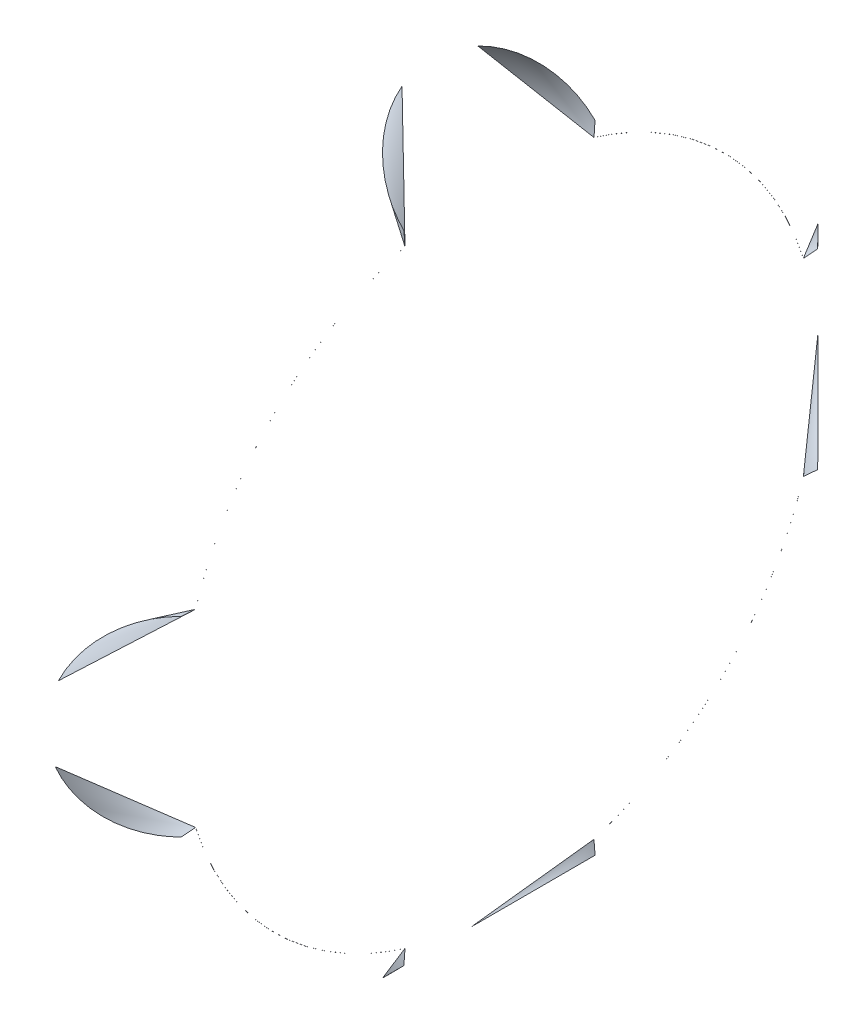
ISO-10303-21;
HEADER;
FILE_DESCRIPTION(('STEP AP214'),'2;1');
FILE_NAME('part.step','',(''),(''),'','','');
FILE_SCHEMA(('AUTOMOTIVE_DESIGN { 1 0 10303 214 1 1 1 1 }'));
ENDSEC;
DATA;
#1=APPLICATION_CONTEXT('core data for automotive mechanical design processes');
#2=APPLICATION_PROTOCOL_DEFINITION('international standard','automotive_design',2000,#1);
#3=PRODUCT_CONTEXT('',#1,'mechanical');
#4=PRODUCT('Part','Part','',(#3));
#5=PRODUCT_RELATED_PRODUCT_CATEGORY('part','',(#4));
#6=PRODUCT_DEFINITION_FORMATION('','',#4);
#7=PRODUCT_DEFINITION_CONTEXT('part definition',#1,'design');
#8=PRODUCT_DEFINITION('design','',#6,#7);
#9=PRODUCT_DEFINITION_SHAPE('','',#8);
#10=(LENGTH_UNIT() NAMED_UNIT(*) SI_UNIT(.MILLI.,.METRE.));
#11=(NAMED_UNIT(*) PLANE_ANGLE_UNIT() SI_UNIT($,.RADIAN.));
#12=(NAMED_UNIT(*) SI_UNIT($,.STERADIAN.) SOLID_ANGLE_UNIT());
#13=UNCERTAINTY_MEASURE_WITH_UNIT(LENGTH_MEASURE(1.E-05),#10,'distance_accuracy_value','');
#14=(GEOMETRIC_REPRESENTATION_CONTEXT(3) GLOBAL_UNCERTAINTY_ASSIGNED_CONTEXT((#13)) GLOBAL_UNIT_ASSIGNED_CONTEXT((#10,
#11,#12)) REPRESENTATION_CONTEXT('',''));
#15=CARTESIAN_POINT('',(0.,0.,0.));
#16=DIRECTION('',(0.,0.,1.));
#17=DIRECTION('',(1.,0.,0.));
#18=AXIS2_PLACEMENT_3D('',#15,#16,#17);
#19=CARTESIAN_POINT('',(4.5,0.,0.));
#20=DIRECTION('',(1.,0.,0.));
#21=DIRECTION('',(0.,-1.,0.));
#22=AXIS2_PLACEMENT_3D('',#19,#20,#21);
#23=TOROIDAL_SURFACE('',#22,10.,0.001);
#24=CARTESIAN_POINT('',(4.49961838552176,-2.96909588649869,-9.55002392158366));
#25=CARTESIAN_POINT('',(4.49956648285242,-2.96909263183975,-9.55000249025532));
#26=CARTESIAN_POINT('',(4.49951638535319,-2.9690887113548,-9.54997667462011));
#27=CARTESIAN_POINT('',(4.49942126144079,-2.9690796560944,-9.54991704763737));
#28=CARTESIAN_POINT('',(4.4993762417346,-2.96907451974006,-9.54988322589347));
#29=CARTESIAN_POINT('',(4.49929260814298,-2.96906319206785,-9.54980863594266));
#30=CARTESIAN_POINT('',(4.49925398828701,-2.9690570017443,-9.54976787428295));
#31=CARTESIAN_POINT('',(4.49918416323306,-2.96904374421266,-9.54968057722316));
#32=CARTESIAN_POINT('',(4.49915295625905,-2.96903667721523,-9.54963404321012));
#33=CARTESIAN_POINT('',(4.49909854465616,-2.96902180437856,-9.54953611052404));
#34=CARTESIAN_POINT('',(4.49907540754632,-2.96901399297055,-9.54948467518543));
#35=CARTESIAN_POINT('',(4.49903810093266,-2.96899790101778,-9.54937871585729));
#36=CARTESIAN_POINT('',(4.49902393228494,-2.96898962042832,-9.54932419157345));
#37=CARTESIAN_POINT('',(4.49900484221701,-2.96897274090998,-9.54921304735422));
#38=CARTESIAN_POINT('',(4.49900001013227,-2.96896413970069,-9.54915641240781));
#39=CARTESIAN_POINT('',(4.49899998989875,-2.96894693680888,-9.54904313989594));
#40=CARTESIAN_POINT('',(4.49900480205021,-2.96893833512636,-9.54898650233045));
#41=CARTESIAN_POINT('',(4.49902398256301,-2.9689213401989,-9.54887460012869));
#42=CARTESIAN_POINT('',(4.49903838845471,-2.96891294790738,-9.54881934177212));
#43=CARTESIAN_POINT('',(4.49907641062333,-2.96889664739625,-9.54871201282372));
#44=CARTESIAN_POINT('',(4.4991000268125,-2.96888873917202,-9.54865994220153));
#45=CARTESIAN_POINT('',(4.49915573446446,-2.9688736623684,-9.54856067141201));
#46=CARTESIAN_POINT('',(4.49918779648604,-2.96886649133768,-9.54851345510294));
#47=CARTESIAN_POINT('',(4.49925955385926,-2.96885306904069,-9.54842507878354));
#48=CARTESIAN_POINT('',(4.49929924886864,-2.96884681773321,-9.5483839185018));
#49=CARTESIAN_POINT('',(4.49938475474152,-2.9688354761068,-9.54830924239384));
#50=CARTESIAN_POINT('',(4.4994305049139,-2.96883037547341,-9.54827565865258));
#51=CARTESIAN_POINT('',(4.4995271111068,-2.96882141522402,-9.5482166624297));
#52=CARTESIAN_POINT('',(4.49957796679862,-2.9688175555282,-9.54819124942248));
#53=CARTESIAN_POINT('',(4.49968273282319,-2.96881123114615,-9.54814960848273));
#54=CARTESIAN_POINT('',(4.49973660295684,-2.96880875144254,-9.54813328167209));
#55=CARTESIAN_POINT('',(4.49984636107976,-2.96880519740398,-9.54810988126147));
#56=CARTESIAN_POINT('',(4.4999022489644,-2.96880412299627,-9.5481028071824));
#57=CARTESIAN_POINT('',(4.50001398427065,-2.96880341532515,-9.54809814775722));
#58=CARTESIAN_POINT('',(4.50006982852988,-2.96880377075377,-9.54810048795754));
#59=CARTESIAN_POINT('',(4.50018032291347,-2.96880588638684,-9.5481144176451));
#60=CARTESIAN_POINT('',(4.50023497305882,-2.96880764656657,-9.54812600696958));
#61=CARTESIAN_POINT('',(4.500341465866,-2.96881251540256,-9.54815806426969));
#62=CARTESIAN_POINT('',(4.50039331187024,-2.96881562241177,-9.5481785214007));
#63=CARTESIAN_POINT('',(4.50049282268,-2.96882309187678,-9.54822770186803));
#64=CARTESIAN_POINT('',(4.50054048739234,-2.96882745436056,-9.54825642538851));
#65=CARTESIAN_POINT('',(4.50063059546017,-2.96883733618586,-9.54832148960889));
#66=CARTESIAN_POINT('',(4.50067300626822,-2.96884286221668,-9.54835787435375));
#67=CARTESIAN_POINT('',(4.50075112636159,-2.96885489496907,-9.54843710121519));
#68=CARTESIAN_POINT('',(4.50078683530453,-2.96886140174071,-9.54847994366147));
#69=CARTESIAN_POINT('',(4.50085093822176,-2.96887528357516,-9.5485713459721));
#70=CARTESIAN_POINT('',(4.50087925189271,-2.96888266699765,-9.54861996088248));
#71=CARTESIAN_POINT('',(4.50092732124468,-2.96889803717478,-9.54872116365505));
#72=CARTESIAN_POINT('',(4.50094707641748,-2.96890602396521,-9.54877375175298));
#73=CARTESIAN_POINT('',(4.50097767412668,-2.96892246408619,-9.5488820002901));
#74=CARTESIAN_POINT('',(4.50098842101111,-2.96893092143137,-9.54893768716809));
#75=CARTESIAN_POINT('',(4.50100036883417,-2.9689479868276,-9.54905005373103));
#76=CARTESIAN_POINT('',(4.50100156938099,-2.96895659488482,-9.54910673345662));
#77=CARTESIAN_POINT('',(4.50099437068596,-2.96897377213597,-9.54921983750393));
#78=CARTESIAN_POINT('',(4.50098591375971,-2.9689823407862,-9.54927625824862));
#79=CARTESIAN_POINT('',(4.50095952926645,-2.96899914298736,-9.54938689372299));
#80=CARTESIAN_POINT('',(4.50094160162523,-2.96900737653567,-9.54944110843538));
#81=CARTESIAN_POINT('',(4.50089678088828,-2.96902326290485,-9.54954571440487));
#82=CARTESIAN_POINT('',(4.50086989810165,-2.96903091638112,-9.54959610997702));
#83=CARTESIAN_POINT('',(4.50080789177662,-2.96904542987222,-9.54969167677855));
#84=CARTESIAN_POINT('',(4.50077276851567,-2.96905228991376,-9.54973684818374));
#85=CARTESIAN_POINT('',(4.50069556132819,-2.96906496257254,-9.54982029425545));
#86=CARTESIAN_POINT('',(4.50065353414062,-2.96907078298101,-9.54985862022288));
#87=CARTESIAN_POINT('',(4.50056350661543,-2.96908126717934,-9.54992765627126));
#88=CARTESIAN_POINT('',(4.50051550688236,-2.96908593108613,-9.54995836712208));
#89=CARTESIAN_POINT('',(4.5004154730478,-2.96909391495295,-9.55001093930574));
#90=CARTESIAN_POINT('',(4.50036349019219,-2.96909724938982,-9.55003289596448));
#91=CARTESIAN_POINT('',(4.50025649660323,-2.96910254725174,-9.55006778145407));
#92=CARTESIAN_POINT('',(4.50020148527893,-2.96910451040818,-9.55008070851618));
#93=CARTESIAN_POINT('',(4.50009054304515,-2.96910699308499,-9.55009705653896));
#94=CARTESIAN_POINT('',(4.50003462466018,-2.96910752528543,-9.55010056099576));
#95=CARTESIAN_POINT('',(4.49992303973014,-2.96910716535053,-9.55009819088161));
#96=CARTESIAN_POINT('',(4.49986737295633,-2.96910627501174,-9.55009232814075));
#97=CARTESIAN_POINT('',(4.49977936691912,-2.96910372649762,-9.55007554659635));
#98=CARTESIAN_POINT('',(4.49974643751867,-2.96910250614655,-9.55006751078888));
#99=CARTESIAN_POINT('',(4.49968158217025,-2.96909956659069,-9.55004815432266));
#100=CARTESIAN_POINT('',(4.4996496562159,-2.96909784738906,-9.55003683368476));
#101=CARTESIAN_POINT('',(4.49961838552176,-2.96909588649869,-9.55002392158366));
#102=B_SPLINE_CURVE_WITH_KNOTS('',3,(#24,#25,#26,#27,#28,#29,#30,#31,#32,#33,#34,#35,#36,#37,
#38,#39,#40,#41,#42,#43,#44,#45,#46,#47,#48,#49,#50,#51,#52,#53,#54,#55,#56,#57,#58,#59,#60,#61,
#62,#63,#64,#65,#66,#67,#68,#69,#70,#71,#72,#73,#74,#75,#76,#77,#78,#79,#80,#81,#82,#83,#84,#85,
#86,#87,#88,#89,#90,#91,#92,#93,#94,#95,#96,#97,#98,#99,#100,#101),.UNSPECIFIED.,.T.,.F.,(4,2,2,
2,2,2,2,2,2,2,2,2,2,2,2,2,2,2,2,2,2,2,2,2,2,2,2,2,2,2,2,2,2,2,2,2,2,2,4),(0.,
0.000168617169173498,0.00033745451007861,0.000506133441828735,0.000674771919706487,
0.000844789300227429,0.00101482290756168,0.00118647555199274,0.00135813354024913,
0.00153046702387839,0.00170279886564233,0.00187453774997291,0.00204626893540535,
0.00221639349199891,0.00238650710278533,0.0025547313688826,0.00272294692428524,
0.00288983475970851,0.00305671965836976,0.00322340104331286,0.00339008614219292,
0.00355775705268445,0.00372543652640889,0.00389486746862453,0.0040643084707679,
0.00423552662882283,0.0044067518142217,0.00457900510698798,0.00475125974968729,
0.00492331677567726,0.00509536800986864,0.00526607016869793,0.00543675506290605,
0.00560552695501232,0.00577433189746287,0.00594163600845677,0.00610872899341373,
0.00621031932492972,0.006311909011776),.UNSPECIFIED.);
#103=CARTESIAN_POINT('',(4.49961838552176,-2.96909588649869,-9.55002392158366));
#104=VERTEX_POINT('',#103);
#105=EDGE_CURVE('E9',#104,#104,#102,.T.);
#106=ORIENTED_EDGE('',*,*,#105,.F.);
#107=EDGE_LOOP('',(#106));
#108=FACE_BOUND('',#107,.T.);
#109=CARTESIAN_POINT('',(4.49961838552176,-9.55002392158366,-2.96909588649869));
#110=CARTESIAN_POINT('',(4.49966970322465,-9.55004510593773,-2.96909910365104));
#111=CARTESIAN_POINT('',(4.49972285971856,-9.55006203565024,-2.96910167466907));
#112=CARTESIAN_POINT('',(4.49983133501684,-9.55008684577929,-2.96910544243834));
#113=CARTESIAN_POINT('',(4.49988665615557,-9.55009471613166,-2.96910663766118));
#114=CARTESIAN_POINT('',(4.49999783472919,-9.55010114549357,-2.96910761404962));
#115=CARTESIAN_POINT('',(4.50005369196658,-9.55009970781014,-2.96910739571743));
#116=CARTESIAN_POINT('',(4.50016435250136,-9.55008757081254,-2.96910555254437));
#117=CARTESIAN_POINT('',(4.50021915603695,-9.55007687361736,-2.96910392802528));
#118=CARTESIAN_POINT('',(4.50032612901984,-9.55004655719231,-2.96909932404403));
#119=CARTESIAN_POINT('',(4.50037830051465,-9.5500269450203,-2.9690963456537));
#120=CARTESIAN_POINT('',(4.50047860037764,-9.54997938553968,-2.96908912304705));
#121=CARTESIAN_POINT('',(4.50052672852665,-9.54995143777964,-2.96908487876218));
#122=CARTESIAN_POINT('',(4.50061787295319,-9.54988784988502,-2.96907522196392));
#123=CARTESIAN_POINT('',(4.5006608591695,-9.54985216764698,-2.96906980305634));
#124=CARTESIAN_POINT('',(4.50074023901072,-9.54977424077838,-2.96905796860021));
#125=CARTESIAN_POINT('',(4.50077663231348,-9.54973199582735,-2.96905155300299));
#126=CARTESIAN_POINT('',(4.50084219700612,-9.54964167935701,-2.96903783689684));
#127=CARTESIAN_POINT('',(4.500871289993,-9.54959355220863,-2.96903052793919));
#128=CARTESIAN_POINT('',(4.50092098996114,-9.54949319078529,-2.96901528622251));
#129=CARTESIAN_POINT('',(4.50094159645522,-9.54944095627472,-2.96900735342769));
#130=CARTESIAN_POINT('',(4.50097395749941,-9.54933326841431,-2.96899099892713));
#131=CARTESIAN_POINT('',(4.50098561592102,-9.54927778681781,-2.96898257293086));
#132=CARTESIAN_POINT('',(4.50099941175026,-9.54916567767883,-2.96896554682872));
#133=CARTESIAN_POINT('',(4.50100154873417,-9.54910905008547,-2.9689569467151));
#134=CARTESIAN_POINT('',(4.50099622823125,-9.54899587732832,-2.96893975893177));
#135=CARTESIAN_POINT('',(4.5009887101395,-9.54893933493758,-2.96893117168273));
#136=CARTESIAN_POINT('',(4.50096417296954,-9.54882830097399,-2.96891430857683));
#137=CARTESIAN_POINT('',(4.5009471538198,-9.54877380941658,-2.96890603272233));
#138=CARTESIAN_POINT('',(4.50090408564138,-9.54866848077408,-2.96889003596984));
#139=CARTESIAN_POINT('',(4.50087804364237,-9.54861764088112,-2.96888231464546));
#140=CARTESIAN_POINT('',(4.50081763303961,-9.54852104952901,-2.96886764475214));
#141=CARTESIAN_POINT('',(4.5007832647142,-9.54847529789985,-2.96886069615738));
#142=CARTESIAN_POINT('',(4.50070744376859,-9.5483905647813,-2.96884782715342));
#143=CARTESIAN_POINT('',(4.50066604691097,-9.54835153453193,-2.96884189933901));
#144=CARTESIAN_POINT('',(4.50057714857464,-9.54828099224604,-2.96883118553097));
#145=CARTESIAN_POINT('',(4.50052964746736,-9.54824947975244,-2.96882639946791));
#146=CARTESIAN_POINT('',(4.50043045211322,-9.54819523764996,-2.96881816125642));
#147=CARTESIAN_POINT('',(4.50037881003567,-9.54817241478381,-2.9688146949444));
#148=CARTESIAN_POINT('',(4.50027235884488,-9.5481357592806,-2.96880912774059));
#149=CARTESIAN_POINT('',(4.50021754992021,-9.54812192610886,-2.96880702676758));
#150=CARTESIAN_POINT('',(4.50010688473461,-9.54810376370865,-2.96880426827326));
#151=CARTESIAN_POINT('',(4.50005104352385,-9.54809934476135,-2.96880359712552));
#152=CARTESIAN_POINT('',(4.49993940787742,-9.54809987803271,-2.9688036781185));
#153=CARTESIAN_POINT('',(4.49988361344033,-9.54810482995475,-2.96880443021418));
#154=CARTESIAN_POINT('',(4.49977387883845,-9.54812391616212,-2.96880732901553));
#155=CARTESIAN_POINT('',(4.49971993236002,-9.54813801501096,-2.96880947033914));
#156=CARTESIAN_POINT('',(4.49961518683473,-9.5481749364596,-2.96881507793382));
#157=CARTESIAN_POINT('',(4.49956438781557,-9.54819775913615,-2.96881854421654));
#158=CARTESIAN_POINT('',(4.49946717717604,-9.548251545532,-2.96882671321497));
#159=CARTESIAN_POINT('',(4.49942078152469,-9.54828253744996,-2.96883142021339));
#160=CARTESIAN_POINT('',(4.49933384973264,-9.54835171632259,-2.96884192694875));
#161=CARTESIAN_POINT('',(4.49929331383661,-9.54838990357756,-2.9688477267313));
#162=CARTESIAN_POINT('',(4.49921884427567,-9.54847276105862,-2.9688603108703));
#163=CARTESIAN_POINT('',(4.49918497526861,-9.54851748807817,-2.96886710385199));
#164=CARTESIAN_POINT('',(4.49912521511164,-9.54861187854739,-2.96888143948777));
#165=CARTESIAN_POINT('',(4.4990993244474,-9.54866154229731,-2.96888898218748));
#166=CARTESIAN_POINT('',(4.49905595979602,-9.54876498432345,-2.96890469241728));
#167=CARTESIAN_POINT('',(4.49903858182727,-9.5488188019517,-2.96891286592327));
#168=CARTESIAN_POINT('',(4.49901312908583,-9.54892854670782,-2.96892953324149));
#169=CARTESIAN_POINT('',(4.49900505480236,-9.54898447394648,-2.96893802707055));
#170=CARTESIAN_POINT('',(4.49899839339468,-9.54909733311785,-2.96895516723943));
#171=CARTESIAN_POINT('',(4.49899988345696,-9.54915426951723,-2.96896381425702));
#172=CARTESIAN_POINT('',(4.49901249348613,-9.54926708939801,-2.96898094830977));
#173=CARTESIAN_POINT('',(4.49902361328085,-9.54932297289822,-2.96898943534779));
#174=CARTESIAN_POINT('',(4.49905521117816,-9.54943218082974,-2.96900602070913));
#175=CARTESIAN_POINT('',(4.49907570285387,-9.54948550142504,-2.96901411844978));
#176=CARTESIAN_POINT('',(4.49912550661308,-9.54958797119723,-2.96902968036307));
#177=CARTESIAN_POINT('',(4.49915482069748,-9.54963711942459,-2.96903714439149));
#178=CARTESIAN_POINT('',(4.49922128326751,-9.54972954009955,-2.96905118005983));
#179=CARTESIAN_POINT('',(4.49925839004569,-9.54977284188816,-2.96905775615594));
#180=CARTESIAN_POINT('',(4.49933947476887,-9.54985254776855,-2.96906986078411));
#181=CARTESIAN_POINT('',(4.49938344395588,-9.54988896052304,-2.96907539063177));
#182=CARTESIAN_POINT('',(4.49945958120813,-9.54994175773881,-2.96908340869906));
#183=CARTESIAN_POINT('',(4.49949006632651,-9.54996055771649,-2.96908626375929));
#184=CARTESIAN_POINT('',(4.49955290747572,-9.54999480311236,-2.9690914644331));
#185=CARTESIAN_POINT('',(4.49958526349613,-9.55001024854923,-2.9690938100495));
#186=CARTESIAN_POINT('',(4.49961838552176,-9.55002392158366,-2.96909588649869));
#187=B_SPLINE_CURVE_WITH_KNOTS('',3,(#109,#110,#111,#112,#113,#114,#115,#116,#117,#118,#119,
#120,#121,#122,#123,#124,#125,#126,#127,#128,#129,#130,#131,#132,#133,#134,#135,#136,#137,#138,
#139,#140,#141,#142,#143,#144,#145,#146,#147,#148,#149,#150,#151,#152,#153,#154,#155,#156,#157,
#158,#159,#160,#161,#162,#163,#164,#165,#166,#167,#168,#169,#170,#171,#172,#173,#174,#175,#176,
#177,#178,#179,#180,#181,#182,#183,#184,#185,#186),.UNSPECIFIED.,.T.,.F.,(4,2,2,2,2,2,2,2,2,2,2,
2,2,2,2,2,2,2,2,2,2,2,2,2,2,2,2,2,2,2,2,2,2,2,2,2,2,2,4),(0.,0.000166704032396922,
0.000333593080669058,0.000500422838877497,0.000667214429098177,0.000833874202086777,
0.00100054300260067,0.00116814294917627,0.00133575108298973,0.00150508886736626,
0.0016744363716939,0.00184557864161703,0.00201672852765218,0.00218895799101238,
0.00236118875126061,0.00253328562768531,0.0027053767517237,0.00287616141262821,
0.00304693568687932,0.0032158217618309,0.00338469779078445,0.00355195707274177,
0.00371921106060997,0.00388582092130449,0.00405243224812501,0.00421962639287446,
0.00438682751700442,0.00455557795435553,0.0047243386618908,0.00489496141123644,
0.00506559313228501,0.00523760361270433,0.00540961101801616,0.00558186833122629,
0.00575416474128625,0.00592556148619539,0.00609674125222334,0.00620433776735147,
0.00631193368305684),.UNSPECIFIED.);
#188=CARTESIAN_POINT('',(4.49961838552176,-9.55002392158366,-2.96909588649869));
#189=VERTEX_POINT('',#188);
#190=EDGE_CURVE('E34',#189,#189,#187,.T.);
#191=ORIENTED_EDGE('',*,*,#190,.F.);
#192=EDGE_LOOP('',(#191));
#193=FACE_BOUND('',#192,.T.);
#194=ADVANCED_FACE('F13',(#108,#193),#23,.T.);
#195=CARTESIAN_POINT('',(4.49961838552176,2.96909588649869,-9.55002392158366));
#196=CARTESIAN_POINT('',(4.49966970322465,2.96909910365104,-9.55004510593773));
#197=CARTESIAN_POINT('',(4.49972285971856,2.96910167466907,-9.55006203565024));
#198=CARTESIAN_POINT('',(4.49983133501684,2.96910544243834,-9.55008684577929));
#199=CARTESIAN_POINT('',(4.49988665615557,2.96910663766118,-9.55009471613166));
#200=CARTESIAN_POINT('',(4.49999783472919,2.96910761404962,-9.55010114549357));
#201=CARTESIAN_POINT('',(4.50005369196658,2.96910739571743,-9.55009970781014));
#202=CARTESIAN_POINT('',(4.50016435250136,2.96910555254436,-9.55008757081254));
#203=CARTESIAN_POINT('',(4.50021915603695,2.96910392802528,-9.55007687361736));
#204=CARTESIAN_POINT('',(4.50032612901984,2.96909932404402,-9.55004655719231));
#205=CARTESIAN_POINT('',(4.50037830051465,2.96909634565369,-9.5500269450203));
#206=CARTESIAN_POINT('',(4.50047860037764,2.96908912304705,-9.54997938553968));
#207=CARTESIAN_POINT('',(4.50052672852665,2.96908487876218,-9.54995143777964));
#208=CARTESIAN_POINT('',(4.50061787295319,2.96907522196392,-9.54988784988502));
#209=CARTESIAN_POINT('',(4.5006608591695,2.96906980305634,-9.54985216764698));
#210=CARTESIAN_POINT('',(4.50074023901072,2.96905796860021,-9.54977424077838));
#211=CARTESIAN_POINT('',(4.50077663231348,2.96905155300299,-9.54973199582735));
#212=CARTESIAN_POINT('',(4.50084219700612,2.96903783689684,-9.54964167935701));
#213=CARTESIAN_POINT('',(4.500871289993,2.96903052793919,-9.54959355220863));
#214=CARTESIAN_POINT('',(4.50092098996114,2.9690152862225,-9.54949319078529));
#215=CARTESIAN_POINT('',(4.50094159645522,2.96900735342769,-9.54944095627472));
#216=CARTESIAN_POINT('',(4.50097395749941,2.96899099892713,-9.54933326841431));
#217=CARTESIAN_POINT('',(4.50098561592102,2.96898257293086,-9.54927778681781));
#218=CARTESIAN_POINT('',(4.50099941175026,2.96896554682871,-9.54916567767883));
#219=CARTESIAN_POINT('',(4.50100154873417,2.9689569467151,-9.54910905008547));
#220=CARTESIAN_POINT('',(4.50099622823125,2.96893975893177,-9.54899587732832));
#221=CARTESIAN_POINT('',(4.5009887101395,2.96893117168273,-9.54893933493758));
#222=CARTESIAN_POINT('',(4.50096417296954,2.96891430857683,-9.54882830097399));
#223=CARTESIAN_POINT('',(4.5009471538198,2.96890603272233,-9.54877380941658));
#224=CARTESIAN_POINT('',(4.50090408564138,2.96889003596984,-9.54866848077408));
#225=CARTESIAN_POINT('',(4.50087804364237,2.96888231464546,-9.54861764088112));
#226=CARTESIAN_POINT('',(4.50081763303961,2.96886764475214,-9.54852104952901));
#227=CARTESIAN_POINT('',(4.5007832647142,2.96886069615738,-9.54847529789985));
#228=CARTESIAN_POINT('',(4.50070744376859,2.96884782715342,-9.5483905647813));
#229=CARTESIAN_POINT('',(4.50066604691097,2.96884189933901,-9.54835153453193));
#230=CARTESIAN_POINT('',(4.50057714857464,2.96883118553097,-9.54828099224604));
#231=CARTESIAN_POINT('',(4.50052964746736,2.96882639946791,-9.54824947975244));
#232=CARTESIAN_POINT('',(4.50043045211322,2.96881816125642,-9.54819523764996));
#233=CARTESIAN_POINT('',(4.50037881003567,2.9688146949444,-9.54817241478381));
#234=CARTESIAN_POINT('',(4.50027235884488,2.96880912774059,-9.5481357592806));
#235=CARTESIAN_POINT('',(4.50021754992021,2.96880702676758,-9.54812192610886));
#236=CARTESIAN_POINT('',(4.50010688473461,2.96880426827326,-9.54810376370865));
#237=CARTESIAN_POINT('',(4.50005104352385,2.96880359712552,-9.54809934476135));
#238=CARTESIAN_POINT('',(4.49993940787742,2.9688036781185,-9.54809987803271));
#239=CARTESIAN_POINT('',(4.49988361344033,2.96880443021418,-9.54810482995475));
#240=CARTESIAN_POINT('',(4.49977387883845,2.96880732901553,-9.54812391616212));
#241=CARTESIAN_POINT('',(4.49971993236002,2.96880947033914,-9.54813801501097));
#242=CARTESIAN_POINT('',(4.49961518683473,2.96881507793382,-9.5481749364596));
#243=CARTESIAN_POINT('',(4.49956438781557,2.96881854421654,-9.54819775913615));
#244=CARTESIAN_POINT('',(4.49946717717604,2.96882671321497,-9.548251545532));
#245=CARTESIAN_POINT('',(4.49942078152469,2.96883142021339,-9.54828253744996));
#246=CARTESIAN_POINT('',(4.49933384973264,2.96884192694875,-9.54835171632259));
#247=CARTESIAN_POINT('',(4.49929331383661,2.96884772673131,-9.54838990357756));
#248=CARTESIAN_POINT('',(4.49921884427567,2.9688603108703,-9.54847276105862));
#249=CARTESIAN_POINT('',(4.49918497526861,2.96886710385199,-9.54851748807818));
#250=CARTESIAN_POINT('',(4.49912521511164,2.96888143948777,-9.54861187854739));
#251=CARTESIAN_POINT('',(4.4990993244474,2.96888898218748,-9.54866154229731));
#252=CARTESIAN_POINT('',(4.49905595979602,2.96890469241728,-9.54876498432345));
#253=CARTESIAN_POINT('',(4.49903858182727,2.96891286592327,-9.5488188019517));
#254=CARTESIAN_POINT('',(4.49901312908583,2.96892953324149,-9.54892854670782));
#255=CARTESIAN_POINT('',(4.49900505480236,2.96893802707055,-9.54898447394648));
#256=CARTESIAN_POINT('',(4.49899839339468,2.96895516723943,-9.54909733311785));
#257=CARTESIAN_POINT('',(4.49899988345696,2.96896381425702,-9.54915426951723));
#258=CARTESIAN_POINT('',(4.49901249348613,2.96898094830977,-9.54926708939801));
#259=CARTESIAN_POINT('',(4.49902361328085,2.96898943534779,-9.54932297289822));
#260=CARTESIAN_POINT('',(4.49905521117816,2.96900602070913,-9.54943218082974));
#261=CARTESIAN_POINT('',(4.49907570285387,2.96901411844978,-9.54948550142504));
#262=CARTESIAN_POINT('',(4.49912550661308,2.96902968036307,-9.54958797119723));
#263=CARTESIAN_POINT('',(4.49915482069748,2.96903714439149,-9.54963711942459));
#264=CARTESIAN_POINT('',(4.49922128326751,2.96905118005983,-9.54972954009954));
#265=CARTESIAN_POINT('',(4.49925839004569,2.96905775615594,-9.54977284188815));
#266=CARTESIAN_POINT('',(4.49933947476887,2.96906986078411,-9.54985254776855));
#267=CARTESIAN_POINT('',(4.49938344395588,2.96907539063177,-9.54988896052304));
#268=CARTESIAN_POINT('',(4.49945958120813,2.96908340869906,-9.54994175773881));
#269=CARTESIAN_POINT('',(4.49949006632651,2.96908626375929,-9.54996055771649));
#270=CARTESIAN_POINT('',(4.49955290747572,2.9690914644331,-9.54999480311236));
#271=CARTESIAN_POINT('',(4.49958526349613,2.9690938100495,-9.55001024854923));
#272=CARTESIAN_POINT('',(4.49961838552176,2.96909588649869,-9.55002392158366));
#273=B_SPLINE_CURVE_WITH_KNOTS('',3,(#195,#196,#197,#198,#199,#200,#201,#202,#203,#204,#205,
#206,#207,#208,#209,#210,#211,#212,#213,#214,#215,#216,#217,#218,#219,#220,#221,#222,#223,#224,
#225,#226,#227,#228,#229,#230,#231,#232,#233,#234,#235,#236,#237,#238,#239,#240,#241,#242,#243,
#244,#245,#246,#247,#248,#249,#250,#251,#252,#253,#254,#255,#256,#257,#258,#259,#260,#261,#262,
#263,#264,#265,#266,#267,#268,#269,#270,#271,#272),.UNSPECIFIED.,.T.,.F.,(4,2,2,2,2,2,2,2,2,2,2,
2,2,2,2,2,2,2,2,2,2,2,2,2,2,2,2,2,2,2,2,2,2,2,2,2,2,2,4),(0.,0.000166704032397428,
0.000333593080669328,0.000500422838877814,0.000667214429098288,0.000833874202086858,
0.00100054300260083,0.00116814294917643,0.0013357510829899,0.00150508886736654,
0.00167443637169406,0.00184557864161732,0.00201672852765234,0.0021889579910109,
0.00236118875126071,0.00253328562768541,0.00270537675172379,0.0028761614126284,
0.00304693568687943,0.00321582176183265,0.00338469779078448,0.00355195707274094,
0.00371921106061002,0.00388582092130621,0.00405243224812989,0.00421962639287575,
0.00438682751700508,0.00455557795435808,0.00472433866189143,0.00489496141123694,
0.00506559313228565,0.00523760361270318,0.00540961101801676,0.00558186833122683,
0.00575416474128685,0.0059255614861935,0.0060967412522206,0.00620433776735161,
0.00631193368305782),.UNSPECIFIED.);
#274=CARTESIAN_POINT('',(4.49961838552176,2.96909588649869,-9.55002392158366));
#275=VERTEX_POINT('',#274);
#276=EDGE_CURVE('E25',#275,#275,#273,.T.);
#277=ORIENTED_EDGE('',*,*,#276,.F.);
#278=EDGE_LOOP('',(#277));
#279=FACE_BOUND('',#278,.T.);
#280=CARTESIAN_POINT('',(4.49953853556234,9.54821244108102,-2.96882077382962));
#281=CARTESIAN_POINT('',(4.49958780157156,9.54818681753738,-2.96881688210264));
#282=CARTESIAN_POINT('',(4.49963927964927,9.54816526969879,-2.96881360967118));
#283=CARTESIAN_POINT('',(4.4997452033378,9.5481310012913,-2.96880840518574));
#284=CARTESIAN_POINT('',(4.49979965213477,9.54811829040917,-2.96880647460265));
#285=CARTESIAN_POINT('',(4.49990992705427,9.54810210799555,-2.96880401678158));
#286=CARTESIAN_POINT('',(4.49996575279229,9.54809863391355,-2.96880348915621));
#287=CARTESIAN_POINT('',(4.50007718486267,9.54810102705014,-2.96880385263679));
#288=CARTESIAN_POINT('',(4.50013279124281,9.54810689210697,-2.96880474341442));
#289=CARTESIAN_POINT('',(4.50024209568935,9.54812775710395,-2.9688079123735));
#290=CARTESIAN_POINT('',(4.50029579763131,9.54814273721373,-2.96881018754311));
#291=CARTESIAN_POINT('',(4.50039991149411,9.54818136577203,-2.96881605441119));
#292=CARTESIAN_POINT('',(4.50045032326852,9.54820501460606,-2.9688196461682));
#293=CARTESIAN_POINT('',(4.50054664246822,9.54826038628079,-2.96882805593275));
#294=CARTESIAN_POINT('',(4.50059253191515,9.5482921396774,-2.96883287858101));
#295=CARTESIAN_POINT('',(4.50067833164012,9.54836274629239,-2.96884360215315));
#296=CARTESIAN_POINT('',(4.5007182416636,9.54840159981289,-2.96884950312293));
#297=CARTESIAN_POINT('',(4.5007913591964,9.54848569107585,-2.96886227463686));
#298=CARTESIAN_POINT('',(4.5008244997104,9.54853098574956,-2.96886915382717));
#299=CARTESIAN_POINT('',(4.50088271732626,9.54862638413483,-2.96888364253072));
#300=CARTESIAN_POINT('',(4.50090779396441,9.54867648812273,-2.96889125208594));
#301=CARTESIAN_POINT('',(4.50094945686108,9.54878067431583,-2.9689070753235));
#302=CARTESIAN_POINT('',(4.50096594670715,9.54883479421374,-2.96891529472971));
#303=CARTESIAN_POINT('',(4.50098958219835,9.54894499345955,-2.96893203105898));
#304=CARTESIAN_POINT('',(4.50099672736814,9.54900107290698,-2.96894054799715));
#305=CARTESIAN_POINT('',(4.50100150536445,9.54911406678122,-2.96895770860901));
#306=CARTESIAN_POINT('',(4.50099906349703,9.54917098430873,-2.96896635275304));
#307=CARTESIAN_POINT('',(4.50098456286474,9.54928361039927,-2.96898345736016));
#308=CARTESIAN_POINT('',(4.50097250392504,9.54933931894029,-2.96899191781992));
#309=CARTESIAN_POINT('',(4.50093906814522,9.5494480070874,-2.96900842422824));
#310=CARTESIAN_POINT('',(4.50091768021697,9.54950098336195,-2.96901646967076));
#311=CARTESIAN_POINT('',(4.50086615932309,9.54960260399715,-2.96903190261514));
#312=CARTESIAN_POINT('',(4.5008360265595,9.54965124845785,-2.96903929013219));
#313=CARTESIAN_POINT('',(4.5007680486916,9.54974249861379,-2.96905314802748));
#314=CARTESIAN_POINT('',(4.5007302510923,9.54978513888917,-2.9690596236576));
#315=CARTESIAN_POINT('',(4.50064788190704,9.54986345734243,-2.96907151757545));
#316=CARTESIAN_POINT('',(4.5006033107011,9.54989913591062,-2.96907693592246));
#317=CARTESIAN_POINT('',(4.50050916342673,9.54996211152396,-2.969086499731));
#318=CARTESIAN_POINT('',(4.50045964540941,9.54998949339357,-2.96909065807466));
#319=CARTESIAN_POINT('',(4.50035662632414,9.55003554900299,-2.969097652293));
#320=CARTESIAN_POINT('',(4.5003031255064,9.55005422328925,-2.96910048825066));
#321=CARTESIAN_POINT('',(4.50019426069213,9.55008214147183,-2.96910472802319));
#322=CARTESIAN_POINT('',(4.50013892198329,9.55009148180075,-2.96910614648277));
#323=CARTESIAN_POINT('',(4.50002744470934,9.5501007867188,-2.96910755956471));
#324=CARTESIAN_POINT('',(4.49997130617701,9.55010075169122,-2.96910755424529));
#325=CARTESIAN_POINT('',(4.49986015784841,9.55009133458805,-2.96910612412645));
#326=CARTESIAN_POINT('',(4.49980514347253,9.55008200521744,-2.96910470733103));
#327=CARTESIAN_POINT('',(4.49969747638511,9.55005436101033,-2.96910050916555));
#328=CARTESIAN_POINT('',(4.49964482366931,9.55003604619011,-2.96909772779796));
#329=CARTESIAN_POINT('',(4.49954327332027,9.54999094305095,-2.96909087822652));
#330=CARTESIAN_POINT('',(4.49949438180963,9.54996414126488,-2.96908680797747));
#331=CARTESIAN_POINT('',(4.49940179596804,9.54990286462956,-2.96907750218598));
#332=CARTESIAN_POINT('',(4.4993581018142,9.54986838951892,-2.96907226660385));
#333=CARTESIAN_POINT('',(4.49927676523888,9.54979245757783,-2.96906073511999));
#334=CARTESIAN_POINT('',(4.49923917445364,9.54975094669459,-2.96905443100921));
#335=CARTESIAN_POINT('',(4.49917148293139,9.54966233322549,-2.96904097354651));
#336=CARTESIAN_POINT('',(4.49914138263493,9.54961523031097,-2.96903382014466));
#337=CARTESIAN_POINT('',(4.49908917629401,9.54951621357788,-2.96901878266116));
#338=CARTESIAN_POINT('',(4.49906716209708,9.54946425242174,-2.96901089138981));
#339=CARTESIAN_POINT('',(4.49903217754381,9.54935743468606,-2.96899466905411));
#340=CARTESIAN_POINT('',(4.49901920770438,9.54930257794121,-2.96898633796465));
#341=CARTESIAN_POINT('',(4.49900257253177,9.54919098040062,-2.9689693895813));
#342=CARTESIAN_POINT('',(4.4989989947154,9.54913422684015,-2.96896077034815));
#343=CARTESIAN_POINT('',(4.49900149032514,9.54902092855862,-2.96894356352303));
#344=CARTESIAN_POINT('',(4.49900756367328,9.54896438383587,-2.96893497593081));
#345=CARTESIAN_POINT('',(4.49902923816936,9.54885290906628,-2.96891804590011));
#346=CARTESIAN_POINT('',(4.49904487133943,9.54879798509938,-2.96890970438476));
#347=CARTESIAN_POINT('',(4.49908528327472,9.54869151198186,-2.96889353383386));
#348=CARTESIAN_POINT('',(4.49911006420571,9.54863996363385,-2.96888570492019));
#349=CARTESIAN_POINT('',(4.49916799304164,9.54854192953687,-2.9688708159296));
#350=CARTESIAN_POINT('',(4.49920111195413,9.54849542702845,-2.96886375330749));
#351=CARTESIAN_POINT('',(4.49927482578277,9.54840869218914,-2.96885058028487));
#352=CARTESIAN_POINT('',(4.49931541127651,9.54836845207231,-2.96884446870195));
#353=CARTESIAN_POINT('',(4.49938674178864,9.54830889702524,-2.96883542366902));
#354=CARTESIAN_POINT('',(4.49941560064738,9.54828733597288,-2.96883214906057));
#355=CARTESIAN_POINT('',(4.49947550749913,9.54824742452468,-2.96882608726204));
#356=CARTESIAN_POINT('',(4.49950655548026,9.54822907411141,-2.96882330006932));
#357=CARTESIAN_POINT('',(4.49953853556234,9.54821244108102,-2.96882077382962));
#358=B_SPLINE_CURVE_WITH_KNOTS('',3,(#280,#281,#282,#283,#284,#285,#286,#287,#288,#289,#290,
#291,#292,#293,#294,#295,#296,#297,#298,#299,#300,#301,#302,#303,#304,#305,#306,#307,#308,#309,
#310,#311,#312,#313,#314,#315,#316,#317,#318,#319,#320,#321,#322,#323,#324,#325,#326,#327,#328,
#329,#330,#331,#332,#333,#334,#335,#336,#337,#338,#339,#340,#341,#342,#343,#344,#345,#346,#347,
#348,#349,#350,#351,#352,#353,#354,#355,#356,#357),.UNSPECIFIED.,.T.,.F.,(4,2,2,2,2,2,2,2,2,2,2,
2,2,2,2,2,2,2,2,2,2,2,2,2,2,2,2,2,2,2,2,2,2,2,2,2,2,2,4),(0.,0.000166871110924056,
0.000333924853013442,0.000500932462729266,0.00066790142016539,0.000834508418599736,
0.00100112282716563,0.00116837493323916,0.00133563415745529,0.00150447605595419,
0.00167332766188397,0.00184403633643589,0.00201475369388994,0.00218680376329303,
0.00235885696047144,0.00253111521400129,0.00270336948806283,0.00287458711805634,
0.00304579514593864,0.0032151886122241,0.00338457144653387,0.00355218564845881,
0.00371979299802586,0.00388645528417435,0.00405311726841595,0.00422004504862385,
0.00438697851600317,0.00455525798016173,0.00472354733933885,0.0048936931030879,
0.00506384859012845,0.00523558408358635,0.00540731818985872,0.00557963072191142,
0.00575198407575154,0.005923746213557,0.00609529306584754,0.00620361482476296,
0.00631193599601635),.UNSPECIFIED.);
#359=CARTESIAN_POINT('',(4.49953853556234,9.54821244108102,-2.96882077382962));
#360=VERTEX_POINT('',#359);
#361=EDGE_CURVE('E78',#360,#360,#358,.T.);
#362=ORIENTED_EDGE('',*,*,#361,.F.);
#363=EDGE_LOOP('',(#362));
#364=FACE_BOUND('',#363,.T.);
#365=ADVANCED_FACE('F101',(#279,#364),#23,.T.);
#366=CARTESIAN_POINT('',(4.49961838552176,-9.55002392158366,2.96909588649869));
#367=CARTESIAN_POINT('',(4.49956648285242,-9.55000249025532,2.96909263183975));
#368=CARTESIAN_POINT('',(4.49951638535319,-9.54997667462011,2.9690887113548));
#369=CARTESIAN_POINT('',(4.49942126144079,-9.54991704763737,2.96907965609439));
#370=CARTESIAN_POINT('',(4.4993762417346,-9.54988322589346,2.96907451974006));
#371=CARTESIAN_POINT('',(4.49929260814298,-9.54980863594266,2.96906319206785));
#372=CARTESIAN_POINT('',(4.49925398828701,-9.54976787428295,2.9690570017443));
#373=CARTESIAN_POINT('',(4.49918416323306,-9.54968057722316,2.96904374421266));
#374=CARTESIAN_POINT('',(4.49915295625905,-9.54963404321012,2.96903667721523));
#375=CARTESIAN_POINT('',(4.49909854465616,-9.54953611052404,2.96902180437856));
#376=CARTESIAN_POINT('',(4.49907540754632,-9.54948467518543,2.96901399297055));
#377=CARTESIAN_POINT('',(4.49903810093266,-9.54937871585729,2.96899790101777));
#378=CARTESIAN_POINT('',(4.49902393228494,-9.54932419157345,2.96898962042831));
#379=CARTESIAN_POINT('',(4.49900484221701,-9.54921304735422,2.96897274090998));
#380=CARTESIAN_POINT('',(4.49900001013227,-9.54915641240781,2.96896413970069));
#381=CARTESIAN_POINT('',(4.49899998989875,-9.54904313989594,2.96894693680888));
#382=CARTESIAN_POINT('',(4.49900480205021,-9.54898650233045,2.96893833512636));
#383=CARTESIAN_POINT('',(4.49902398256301,-9.54887460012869,2.9689213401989));
#384=CARTESIAN_POINT('',(4.49903838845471,-9.54881934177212,2.96891294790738));
#385=CARTESIAN_POINT('',(4.49907641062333,-9.54871201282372,2.96889664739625));
#386=CARTESIAN_POINT('',(4.4991000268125,-9.54865994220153,2.96888873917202));
#387=CARTESIAN_POINT('',(4.49915573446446,-9.54856067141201,2.9688736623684));
#388=CARTESIAN_POINT('',(4.49918779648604,-9.54851345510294,2.96886649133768));
#389=CARTESIAN_POINT('',(4.49925955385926,-9.54842507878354,2.96885306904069));
#390=CARTESIAN_POINT('',(4.49929924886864,-9.5483839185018,2.96884681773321));
#391=CARTESIAN_POINT('',(4.49938475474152,-9.54830924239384,2.9688354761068));
#392=CARTESIAN_POINT('',(4.4994305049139,-9.54827565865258,2.96883037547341));
#393=CARTESIAN_POINT('',(4.4995271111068,-9.5482166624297,2.96882141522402));
#394=CARTESIAN_POINT('',(4.49957796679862,-9.54819124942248,2.96881755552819));
#395=CARTESIAN_POINT('',(4.49968273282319,-9.54814960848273,2.96881123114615));
#396=CARTESIAN_POINT('',(4.49973660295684,-9.54813328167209,2.96880875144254));
#397=CARTESIAN_POINT('',(4.49984636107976,-9.54810988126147,2.96880519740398));
#398=CARTESIAN_POINT('',(4.4999022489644,-9.5481028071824,2.96880412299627));
#399=CARTESIAN_POINT('',(4.50001398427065,-9.54809814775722,2.96880341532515));
#400=CARTESIAN_POINT('',(4.50006982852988,-9.54810048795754,2.96880377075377));
#401=CARTESIAN_POINT('',(4.50018032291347,-9.5481144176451,2.96880588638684));
#402=CARTESIAN_POINT('',(4.50023497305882,-9.54812600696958,2.96880764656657));
#403=CARTESIAN_POINT('',(4.500341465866,-9.54815806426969,2.96881251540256));
#404=CARTESIAN_POINT('',(4.50039331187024,-9.5481785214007,2.96881562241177));
#405=CARTESIAN_POINT('',(4.50049282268,-9.54822770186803,2.96882309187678));
#406=CARTESIAN_POINT('',(4.50054048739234,-9.54825642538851,2.96882745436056));
#407=CARTESIAN_POINT('',(4.50063059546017,-9.54832148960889,2.96883733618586));
#408=CARTESIAN_POINT('',(4.50067300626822,-9.54835787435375,2.96884286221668));
#409=CARTESIAN_POINT('',(4.50075112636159,-9.54843710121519,2.96885489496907));
#410=CARTESIAN_POINT('',(4.50078683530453,-9.54847994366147,2.96886140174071));
#411=CARTESIAN_POINT('',(4.50085093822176,-9.5485713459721,2.96887528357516));
#412=CARTESIAN_POINT('',(4.50087925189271,-9.54861996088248,2.96888266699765));
#413=CARTESIAN_POINT('',(4.50092732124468,-9.54872116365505,2.96889803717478));
#414=CARTESIAN_POINT('',(4.50094707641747,-9.54877375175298,2.96890602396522));
#415=CARTESIAN_POINT('',(4.50097767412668,-9.5488820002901,2.96892246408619));
#416=CARTESIAN_POINT('',(4.50098842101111,-9.54893768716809,2.96893092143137));
#417=CARTESIAN_POINT('',(4.50100036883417,-9.54905005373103,2.9689479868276));
#418=CARTESIAN_POINT('',(4.50100156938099,-9.54910673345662,2.96895659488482));
#419=CARTESIAN_POINT('',(4.50099437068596,-9.54921983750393,2.96897377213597));
#420=CARTESIAN_POINT('',(4.50098591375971,-9.54927625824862,2.9689823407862));
#421=CARTESIAN_POINT('',(4.50095952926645,-9.54938689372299,2.96899914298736));
#422=CARTESIAN_POINT('',(4.50094160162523,-9.54944110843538,2.96900737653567));
#423=CARTESIAN_POINT('',(4.50089678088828,-9.54954571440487,2.96902326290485));
#424=CARTESIAN_POINT('',(4.50086989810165,-9.54959610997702,2.96903091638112));
#425=CARTESIAN_POINT('',(4.50080789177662,-9.54969167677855,2.96904542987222));
#426=CARTESIAN_POINT('',(4.50077276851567,-9.54973684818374,2.96905228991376));
#427=CARTESIAN_POINT('',(4.50069556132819,-9.54982029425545,2.96906496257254));
#428=CARTESIAN_POINT('',(4.50065353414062,-9.54985862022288,2.96907078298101));
#429=CARTESIAN_POINT('',(4.50056350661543,-9.54992765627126,2.96908126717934));
#430=CARTESIAN_POINT('',(4.50051550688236,-9.54995836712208,2.96908593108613));
#431=CARTESIAN_POINT('',(4.5004154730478,-9.55001093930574,2.96909391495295));
#432=CARTESIAN_POINT('',(4.50036349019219,-9.55003289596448,2.96909724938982));
#433=CARTESIAN_POINT('',(4.50025649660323,-9.55006778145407,2.96910254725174));
#434=CARTESIAN_POINT('',(4.50020148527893,-9.55008070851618,2.96910451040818));
#435=CARTESIAN_POINT('',(4.50009054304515,-9.55009705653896,2.96910699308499));
#436=CARTESIAN_POINT('',(4.50003462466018,-9.55010056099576,2.96910752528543));
#437=CARTESIAN_POINT('',(4.49992303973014,-9.55009819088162,2.96910716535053));
#438=CARTESIAN_POINT('',(4.49986737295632,-9.55009232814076,2.96910627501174));
#439=CARTESIAN_POINT('',(4.49977936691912,-9.55007554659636,2.96910372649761));
#440=CARTESIAN_POINT('',(4.49974643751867,-9.55006751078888,2.96910250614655));
#441=CARTESIAN_POINT('',(4.49968158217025,-9.55004815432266,2.96909956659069));
#442=CARTESIAN_POINT('',(4.4996496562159,-9.55003683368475,2.96909784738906));
#443=CARTESIAN_POINT('',(4.49961838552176,-9.55002392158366,2.96909588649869));
#444=B_SPLINE_CURVE_WITH_KNOTS('',3,(#366,#367,#368,#369,#370,#371,#372,#373,#374,#375,#376,
#377,#378,#379,#380,#381,#382,#383,#384,#385,#386,#387,#388,#389,#390,#391,#392,#393,#394,#395,
#396,#397,#398,#399,#400,#401,#402,#403,#404,#405,#406,#407,#408,#409,#410,#411,#412,#413,#414,
#415,#416,#417,#418,#419,#420,#421,#422,#423,#424,#425,#426,#427,#428,#429,#430,#431,#432,#433,
#434,#435,#436,#437,#438,#439,#440,#441,#442,#443),.UNSPECIFIED.,.T.,.F.,(4,2,2,2,2,2,2,2,2,2,2,
2,2,2,2,2,2,2,2,2,2,2,2,2,2,2,2,2,2,2,2,2,2,2,2,2,2,2,4),(0.,0.000168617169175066,
0.000337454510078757,0.000506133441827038,0.000674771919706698,0.000844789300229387,
0.00101482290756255,0.00118647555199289,0.00135813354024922,0.00153046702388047,
0.00170279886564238,0.00187453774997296,0.0020462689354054,0.00221639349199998,
0.00238650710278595,0.00255473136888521,0.00272294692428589,0.00288983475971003,
0.00305671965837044,0.00322340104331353,0.00339008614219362,0.00355775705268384,
0.00372543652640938,0.00389486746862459,0.00406430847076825,0.00423552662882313,
0.00440675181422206,0.00457900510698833,0.00475125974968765,0.00492331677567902,
0.00509536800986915,0.00526607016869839,0.00543675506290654,0.00560552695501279,
0.00577433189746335,0.00594163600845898,0.00610872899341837,0.00621031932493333,
0.00631190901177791),.UNSPECIFIED.);
#445=CARTESIAN_POINT('',(4.49961838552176,-9.55002392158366,2.96909588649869));
#446=VERTEX_POINT('',#445);
#447=EDGE_CURVE('E41',#446,#446,#444,.T.);
#448=ORIENTED_EDGE('',*,*,#447,.F.);
#449=EDGE_LOOP('',(#448));
#450=FACE_BOUND('',#449,.T.);
#451=CARTESIAN_POINT('',(4.49953853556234,-2.96882077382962,9.54821244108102));
#452=CARTESIAN_POINT('',(4.4994886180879,-2.96882471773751,9.54823840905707));
#453=CARTESIAN_POINT('',(4.49944089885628,-2.96882930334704,9.54826860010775));
#454=CARTESIAN_POINT('',(4.49935124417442,-2.96883961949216,9.54833652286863));
#455=CARTESIAN_POINT('',(4.49930931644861,-2.96884535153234,9.54837426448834));
#456=CARTESIAN_POINT('',(4.49923248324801,-2.96885778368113,9.54845612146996));
#457=CARTESIAN_POINT('',(4.49919757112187,-2.96886448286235,9.54850023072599));
#458=CARTESIAN_POINT('',(4.49913567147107,-2.9688786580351,9.5485935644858));
#459=CARTESIAN_POINT('',(4.49910868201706,-2.9688861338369,9.54864278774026));
#460=CARTESIAN_POINT('',(4.4990631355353,-2.96890171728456,9.5487453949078));
#461=CARTESIAN_POINT('',(4.49904464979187,-2.96890982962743,9.54879880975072));
#462=CARTESIAN_POINT('',(4.4990169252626,-2.96892640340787,9.54890793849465));
#463=CARTESIAN_POINT('',(4.49900768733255,-2.96893486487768,9.54896365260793));
#464=CARTESIAN_POINT('',(4.49899866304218,-2.96895197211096,9.54907629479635));
#465=CARTESIAN_POINT('',(4.49899895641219,-2.96896061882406,9.54913322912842));
#466=CARTESIAN_POINT('',(4.4990091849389,-2.96897778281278,9.54924624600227));
#467=CARTESIAN_POINT('',(4.49901912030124,-2.96898630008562,9.54930232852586));
#468=CARTESIAN_POINT('',(4.49904840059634,-2.96900298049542,9.54941216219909));
#469=CARTESIAN_POINT('',(4.49906776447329,-2.96901114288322,9.54946590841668));
#470=CARTESIAN_POINT('',(4.49911539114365,-2.96902685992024,9.54956939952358));
#471=CARTESIAN_POINT('',(4.49914365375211,-2.9690344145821,9.54961914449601));
#472=CARTESIAN_POINT('',(4.49920813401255,-2.9690486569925,9.54971292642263));
#473=CARTESIAN_POINT('',(4.49924430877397,-2.96905534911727,9.54975699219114));
#474=CARTESIAN_POINT('',(4.49932369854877,-2.96906771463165,9.549838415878));
#475=CARTESIAN_POINT('',(4.49936691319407,-2.96907338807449,9.54987577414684));
#476=CARTESIAN_POINT('',(4.49945868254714,-2.96908349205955,9.54994230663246));
#477=CARTESIAN_POINT('',(4.49950717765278,-2.96908793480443,9.54997156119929));
#478=CARTESIAN_POINT('',(4.49960848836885,-2.96909551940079,9.55002150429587));
#479=CARTESIAN_POINT('',(4.49966130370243,-2.96909866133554,9.55004219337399));
#480=CARTESIAN_POINT('',(4.49976914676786,-2.96910352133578,9.55007419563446));
#481=CARTESIAN_POINT('',(4.49982414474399,-2.96910525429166,9.55008560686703));
#482=CARTESIAN_POINT('',(4.49993529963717,-2.96910729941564,9.5500990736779));
#483=CARTESIAN_POINT('',(4.49999145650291,-2.96910761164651,9.55010112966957));
#484=CARTESIAN_POINT('',(4.5001029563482,-2.96910680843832,9.55009584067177));
#485=CARTESIAN_POINT('',(4.50015830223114,-2.96910570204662,9.55008855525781));
#486=CARTESIAN_POINT('',(4.50026697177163,-2.96910211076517,9.55006490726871));
#487=CARTESIAN_POINT('',(4.50032029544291,-2.96909962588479,9.55004854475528));
#488=CARTESIAN_POINT('',(4.50042346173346,-2.96909334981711,9.55000721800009));
#489=CARTESIAN_POINT('',(4.50047330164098,-2.96908955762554,9.54998224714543));
#490=CARTESIAN_POINT('',(4.50056807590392,-2.96908077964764,9.54992444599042));
#491=CARTESIAN_POINT('',(4.50061301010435,-2.96907579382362,9.54989161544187));
#492=CARTESIAN_POINT('',(4.50069706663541,-2.96906473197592,9.54981877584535));
#493=CARTESIAN_POINT('',(4.50073614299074,-2.96905864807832,9.54977871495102));
#494=CARTESIAN_POINT('',(4.50080702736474,-2.96904559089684,9.54969273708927));
#495=CARTESIAN_POINT('',(4.50083883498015,-2.96903861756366,9.54964681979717));
#496=CARTESIAN_POINT('',(4.50089464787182,-2.96902389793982,9.54954989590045));
#497=CARTESIAN_POINT('',(4.50091856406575,-2.96901614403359,9.54949883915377));
#498=CARTESIAN_POINT('',(4.50095748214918,-2.96900014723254,9.54939350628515));
#499=CARTESIAN_POINT('',(4.50097248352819,-2.96899190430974,9.54933922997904));
#500=CARTESIAN_POINT('',(4.50099328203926,-2.96897507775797,9.54922843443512));
#501=CARTESIAN_POINT('',(4.5009989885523,-2.96896649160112,9.54917189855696));
#502=CARTESIAN_POINT('',(4.50100076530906,-2.96894929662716,9.54905867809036));
#503=CARTESIAN_POINT('',(4.50099683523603,-2.96894068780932,9.5490019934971));
#504=CARTESIAN_POINT('',(4.5009794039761,-2.96892365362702,9.54888983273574));
#505=CARTESIAN_POINT('',(4.50096586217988,-2.96891522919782,9.54883436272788));
#506=CARTESIAN_POINT('',(4.50092952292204,-2.96889884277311,9.54872646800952));
#507=CARTESIAN_POINT('',(4.50090672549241,-2.968890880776,9.54867404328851));
#508=CARTESIAN_POINT('',(4.50085257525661,-2.96887567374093,9.54857391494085));
#509=CARTESIAN_POINT('',(4.50082124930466,-2.9688684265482,9.54852619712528));
#510=CARTESIAN_POINT('',(4.50075086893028,-2.9688548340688,9.54843670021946));
#511=CARTESIAN_POINT('',(4.50071181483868,-2.96884848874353,9.54839492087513));
#512=CARTESIAN_POINT('',(4.5006274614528,-2.96883694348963,9.5483189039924));
#513=CARTESIAN_POINT('',(4.50058222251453,-2.96883173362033,9.54828460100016));
#514=CARTESIAN_POINT('',(4.50048650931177,-2.96882254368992,9.54822409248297));
#515=CARTESIAN_POINT('',(4.50043603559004,-2.96881856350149,9.54819788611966));
#516=CARTESIAN_POINT('',(4.50033189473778,-2.96881199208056,9.54815461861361));
#517=CARTESIAN_POINT('',(4.50027826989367,-2.96880938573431,9.54813745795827));
#518=CARTESIAN_POINT('',(4.50016884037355,-2.96880557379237,9.54811235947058));
#519=CARTESIAN_POINT('',(4.50011303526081,-2.96880436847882,9.54810442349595));
#520=CARTESIAN_POINT('',(4.50000130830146,-2.96880340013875,9.54809804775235));
#521=CARTESIAN_POINT('',(4.49994539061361,-2.96880362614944,9.54809953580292));
#522=CARTESIAN_POINT('',(4.49983465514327,-2.96880548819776,9.54811179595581));
#523=CARTESIAN_POINT('',(4.49977983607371,-2.96880712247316,9.54812255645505));
#524=CARTESIAN_POINT('',(4.49969386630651,-2.96881083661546,9.54814701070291));
#525=CARTESIAN_POINT('',(4.49966187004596,-2.96881248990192,9.54815789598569));
#526=CARTESIAN_POINT('',(4.49959916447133,-2.96881627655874,9.54818282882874));
#527=CARTESIAN_POINT('',(4.4995684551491,-2.96881840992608,9.54819687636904));
#528=CARTESIAN_POINT('',(4.49953853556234,-2.96882077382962,9.54821244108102));
#529=B_SPLINE_CURVE_WITH_KNOTS('',3,(#451,#452,#453,#454,#455,#456,#457,#458,#459,#460,#461,
#462,#463,#464,#465,#466,#467,#468,#469,#470,#471,#472,#473,#474,#475,#476,#477,#478,#479,#480,
#481,#482,#483,#484,#485,#486,#487,#488,#489,#490,#491,#492,#493,#494,#495,#496,#497,#498,#499,
#500,#501,#502,#503,#504,#505,#506,#507,#508,#509,#510,#511,#512,#513,#514,#515,#516,#517,#518,
#519,#520,#521,#522,#523,#524,#525,#526,#527,#528),.UNSPECIFIED.,.T.,.F.,(4,2,2,2,2,2,2,2,2,2,2,
2,2,2,2,2,2,2,2,2,2,2,2,2,2,2,2,2,2,2,2,2,2,2,2,2,2,2,4),(0.,0.000169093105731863,
0.000338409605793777,0.000507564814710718,0.00067667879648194,0.000847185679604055,
0.00101770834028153,0.00118965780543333,0.00136161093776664,0.00153391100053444,
0.00170620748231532,0.00187759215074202,0.00204896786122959,0.00221857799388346,
0.0023881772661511,0.00255595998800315,0.00272373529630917,0.00289044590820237,
0.00305715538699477,0.00322399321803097,0.00339083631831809,0.00355892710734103,
0.00372702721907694,0.00389696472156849,0.00406691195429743,0.00423850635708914,
0.00441010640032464,0.00458243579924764,0.00475476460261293,0.0049265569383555,
0.00509834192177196,0.00526855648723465,0.00543875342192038,0.00560703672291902,
0.00577535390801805,0.00594238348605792,0.00610920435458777,0.00621055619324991,
0.00631190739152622),.UNSPECIFIED.);
#530=CARTESIAN_POINT('',(4.49953853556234,-2.96882077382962,9.54821244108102));
#531=VERTEX_POINT('',#530);
#532=EDGE_CURVE('E66',#531,#531,#529,.T.);
#533=ORIENTED_EDGE('',*,*,#532,.F.);
#534=EDGE_LOOP('',(#533));
#535=FACE_BOUND('',#534,.T.);
#536=ADVANCED_FACE('F97',(#450,#535),#23,.T.);
#537=CARTESIAN_POINT('',(4.49953853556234,2.96882077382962,9.54821244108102));
#538=CARTESIAN_POINT('',(4.49958780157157,2.96881688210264,9.54818681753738));
#539=CARTESIAN_POINT('',(4.49963927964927,2.96881360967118,9.54816526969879));
#540=CARTESIAN_POINT('',(4.4997452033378,2.96880840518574,9.5481310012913));
#541=CARTESIAN_POINT('',(4.49979965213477,2.96880647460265,9.54811829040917));
#542=CARTESIAN_POINT('',(4.49990992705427,2.96880401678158,9.54810210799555));
#543=CARTESIAN_POINT('',(4.49996575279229,2.96880348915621,9.54809863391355));
#544=CARTESIAN_POINT('',(4.50007718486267,2.96880385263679,9.54810102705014));
#545=CARTESIAN_POINT('',(4.50013279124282,2.96880474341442,9.54810689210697));
#546=CARTESIAN_POINT('',(4.50024209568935,2.9688079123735,9.54812775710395));
#547=CARTESIAN_POINT('',(4.50029579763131,2.96881018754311,9.54814273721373));
#548=CARTESIAN_POINT('',(4.50039991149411,2.96881605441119,9.54818136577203));
#549=CARTESIAN_POINT('',(4.50045032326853,2.96881964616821,9.54820501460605));
#550=CARTESIAN_POINT('',(4.50054664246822,2.96882805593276,9.54826038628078));
#551=CARTESIAN_POINT('',(4.50059253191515,2.96883287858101,9.54829213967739));
#552=CARTESIAN_POINT('',(4.50067833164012,2.96884360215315,9.54836274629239));
#553=CARTESIAN_POINT('',(4.5007182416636,2.96884950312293,9.54840159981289));
#554=CARTESIAN_POINT('',(4.50079135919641,2.96886227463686,9.54848569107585));
#555=CARTESIAN_POINT('',(4.5008244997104,2.96886915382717,9.54853098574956));
#556=CARTESIAN_POINT('',(4.50088271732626,2.96888364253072,9.54862638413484));
#557=CARTESIAN_POINT('',(4.50090779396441,2.96889125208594,9.54867648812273));
#558=CARTESIAN_POINT('',(4.50094945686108,2.9689070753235,9.54878067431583));
#559=CARTESIAN_POINT('',(4.50096594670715,2.96891529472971,9.54883479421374));
#560=CARTESIAN_POINT('',(4.50098958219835,2.96893203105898,9.54894499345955));
#561=CARTESIAN_POINT('',(4.50099672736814,2.96894054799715,9.54900107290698));
#562=CARTESIAN_POINT('',(4.50100150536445,2.96895770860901,9.54911406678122));
#563=CARTESIAN_POINT('',(4.50099906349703,2.96896635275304,9.54917098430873));
#564=CARTESIAN_POINT('',(4.50098456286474,2.96898345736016,9.54928361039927));
#565=CARTESIAN_POINT('',(4.50097250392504,2.96899191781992,9.54933931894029));
#566=CARTESIAN_POINT('',(4.50093906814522,2.96900842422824,9.5494480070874));
#567=CARTESIAN_POINT('',(4.50091768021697,2.96901646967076,9.54950098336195));
#568=CARTESIAN_POINT('',(4.50086615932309,2.96903190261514,9.54960260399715));
#569=CARTESIAN_POINT('',(4.5008360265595,2.96903929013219,9.54965124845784));
#570=CARTESIAN_POINT('',(4.5007680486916,2.96905314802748,9.54974249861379));
#571=CARTESIAN_POINT('',(4.5007302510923,2.9690596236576,9.54978513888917));
#572=CARTESIAN_POINT('',(4.50064788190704,2.96907151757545,9.54986345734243));
#573=CARTESIAN_POINT('',(4.5006033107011,2.96907693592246,9.54989913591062));
#574=CARTESIAN_POINT('',(4.50050916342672,2.969086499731,9.54996211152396));
#575=CARTESIAN_POINT('',(4.5004596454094,2.96909065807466,9.54998949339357));
#576=CARTESIAN_POINT('',(4.50035662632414,2.969097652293,9.55003554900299));
#577=CARTESIAN_POINT('',(4.5003031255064,2.96910048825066,9.55005422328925));
#578=CARTESIAN_POINT('',(4.50019426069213,2.96910472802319,9.55008214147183));
#579=CARTESIAN_POINT('',(4.50013892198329,2.96910614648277,9.55009148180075));
#580=CARTESIAN_POINT('',(4.50002744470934,2.96910755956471,9.5501007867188));
#581=CARTESIAN_POINT('',(4.49997130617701,2.96910755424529,9.55010075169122));
#582=CARTESIAN_POINT('',(4.49986015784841,2.96910612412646,9.55009133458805));
#583=CARTESIAN_POINT('',(4.49980514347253,2.96910470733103,9.55008200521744));
#584=CARTESIAN_POINT('',(4.49969747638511,2.96910050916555,9.55005436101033));
#585=CARTESIAN_POINT('',(4.49964482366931,2.96909772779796,9.55003604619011));
#586=CARTESIAN_POINT('',(4.49954327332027,2.96909087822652,9.54999094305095));
#587=CARTESIAN_POINT('',(4.49949438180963,2.96908680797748,9.54996414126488));
#588=CARTESIAN_POINT('',(4.49940179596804,2.96907750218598,9.54990286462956));
#589=CARTESIAN_POINT('',(4.4993581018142,2.96907226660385,9.54986838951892));
#590=CARTESIAN_POINT('',(4.49927676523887,2.96906073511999,9.54979245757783));
#591=CARTESIAN_POINT('',(4.49923917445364,2.96905443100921,9.54975094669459));
#592=CARTESIAN_POINT('',(4.49917148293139,2.96904097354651,9.54966233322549));
#593=CARTESIAN_POINT('',(4.49914138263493,2.96903382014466,9.54961523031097));
#594=CARTESIAN_POINT('',(4.49908917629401,2.96901878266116,9.54951621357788));
#595=CARTESIAN_POINT('',(4.49906716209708,2.96901089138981,9.54946425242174));
#596=CARTESIAN_POINT('',(4.49903217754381,2.96899466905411,9.54935743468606));
#597=CARTESIAN_POINT('',(4.49901920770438,2.96898633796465,9.54930257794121));
#598=CARTESIAN_POINT('',(4.49900257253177,2.9689693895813,9.54919098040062));
#599=CARTESIAN_POINT('',(4.4989989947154,2.96896077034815,9.54913422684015));
#600=CARTESIAN_POINT('',(4.49900149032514,2.96894356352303,9.54902092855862));
#601=CARTESIAN_POINT('',(4.49900756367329,2.96893497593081,9.54896438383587));
#602=CARTESIAN_POINT('',(4.49902923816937,2.96891804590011,9.54885290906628));
#603=CARTESIAN_POINT('',(4.49904487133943,2.96890970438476,9.54879798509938));
#604=CARTESIAN_POINT('',(4.49908528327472,2.96889353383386,9.54869151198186));
#605=CARTESIAN_POINT('',(4.49911006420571,2.96888570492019,9.54863996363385));
#606=CARTESIAN_POINT('',(4.49916799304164,2.9688708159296,9.54854192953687));
#607=CARTESIAN_POINT('',(4.49920111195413,2.96886375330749,9.54849542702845));
#608=CARTESIAN_POINT('',(4.49927482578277,2.96885058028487,9.54840869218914));
#609=CARTESIAN_POINT('',(4.49931541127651,2.96884446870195,9.54836845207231));
#610=CARTESIAN_POINT('',(4.49938674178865,2.96883542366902,9.54830889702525));
#611=CARTESIAN_POINT('',(4.49941560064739,2.96883214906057,9.54828733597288));
#612=CARTESIAN_POINT('',(4.49947550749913,2.96882608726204,9.54824742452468));
#613=CARTESIAN_POINT('',(4.49950655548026,2.96882330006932,9.54822907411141));
#614=CARTESIAN_POINT('',(4.49953853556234,2.96882077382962,9.54821244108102));
#615=B_SPLINE_CURVE_WITH_KNOTS('',3,(#537,#538,#539,#540,#541,#542,#543,#544,#545,#546,#547,
#548,#549,#550,#551,#552,#553,#554,#555,#556,#557,#558,#559,#560,#561,#562,#563,#564,#565,#566,
#567,#568,#569,#570,#571,#572,#573,#574,#575,#576,#577,#578,#579,#580,#581,#582,#583,#584,#585,
#586,#587,#588,#589,#590,#591,#592,#593,#594,#595,#596,#597,#598,#599,#600,#601,#602,#603,#604,
#605,#606,#607,#608,#609,#610,#611,#612,#613,#614),.UNSPECIFIED.,.T.,.F.,(4,2,2,2,2,2,2,2,2,2,2,
2,2,2,2,2,2,2,2,2,2,2,2,2,2,2,2,2,2,2,2,2,2,2,2,2,2,2,4),(0.,0.000166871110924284,
0.0003339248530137,0.000500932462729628,0.000667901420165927,0.000834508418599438,
0.00100112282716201,0.00116837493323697,0.00133563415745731,0.00150447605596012,
0.00167332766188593,0.00184403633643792,0.00201475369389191,0.00218680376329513,
0.00235885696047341,0.00253111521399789,0.0027033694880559,0.00287458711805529,
0.00304579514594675,0.00321518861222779,0.00338457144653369,0.00355218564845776,
0.00371979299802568,0.00388645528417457,0.00405311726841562,0.00422004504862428,
0.00438697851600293,0.00455525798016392,0.00472354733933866,0.00489369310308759,
0.00506384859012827,0.00523558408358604,0.00540731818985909,0.00557963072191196,
0.00575198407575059,0.00592374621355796,0.00609529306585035,0.00620361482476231,
0.00631193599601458),.UNSPECIFIED.);
#616=CARTESIAN_POINT('',(4.49953853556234,2.96882077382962,9.54821244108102));
#617=VERTEX_POINT('',#616);
#618=EDGE_CURVE('E72',#617,#617,#615,.T.);
#619=ORIENTED_EDGE('',*,*,#618,.F.);
#620=EDGE_LOOP('',(#619));
#621=FACE_BOUND('',#620,.T.);
#622=CARTESIAN_POINT('',(4.49953853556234,9.54821244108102,2.96882077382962));
#623=CARTESIAN_POINT('',(4.4994886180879,9.54823840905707,2.96882471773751));
#624=CARTESIAN_POINT('',(4.49944089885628,9.54826860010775,2.96882930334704));
#625=CARTESIAN_POINT('',(4.49935124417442,9.54833652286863,2.96883961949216));
#626=CARTESIAN_POINT('',(4.49930931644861,9.54837426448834,2.96884535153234));
#627=CARTESIAN_POINT('',(4.49923248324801,9.54845612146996,2.96885778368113));
#628=CARTESIAN_POINT('',(4.49919757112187,9.54850023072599,2.96886448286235));
#629=CARTESIAN_POINT('',(4.49913567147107,9.5485935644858,2.9688786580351));
#630=CARTESIAN_POINT('',(4.49910868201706,9.54864278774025,2.9688861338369));
#631=CARTESIAN_POINT('',(4.4990631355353,9.54874539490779,2.96890171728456));
#632=CARTESIAN_POINT('',(4.49904464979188,9.54879880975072,2.96890982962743));
#633=CARTESIAN_POINT('',(4.4990169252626,9.54890793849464,2.96892640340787));
#634=CARTESIAN_POINT('',(4.49900768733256,9.54896365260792,2.96893486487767));
#635=CARTESIAN_POINT('',(4.49899866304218,9.54907629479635,2.96895197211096));
#636=CARTESIAN_POINT('',(4.49899895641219,9.54913322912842,2.96896061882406));
#637=CARTESIAN_POINT('',(4.4990091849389,9.54924624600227,2.96897778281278));
#638=CARTESIAN_POINT('',(4.49901912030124,9.54930232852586,2.96898630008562));
#639=CARTESIAN_POINT('',(4.49904840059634,9.54941216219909,2.96900298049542));
#640=CARTESIAN_POINT('',(4.49906776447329,9.54946590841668,2.96901114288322));
#641=CARTESIAN_POINT('',(4.49911539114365,9.54956939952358,2.96902685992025));
#642=CARTESIAN_POINT('',(4.49914365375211,9.54961914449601,2.9690344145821));
#643=CARTESIAN_POINT('',(4.49920813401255,9.54971292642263,2.9690486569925));
#644=CARTESIAN_POINT('',(4.49924430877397,9.54975699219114,2.96905534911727));
#645=CARTESIAN_POINT('',(4.49932369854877,9.549838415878,2.96906771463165));
#646=CARTESIAN_POINT('',(4.49936691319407,9.54987577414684,2.96907338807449));
#647=CARTESIAN_POINT('',(4.49945868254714,9.54994230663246,2.96908349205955));
#648=CARTESIAN_POINT('',(4.49950717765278,9.54997156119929,2.96908793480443));
#649=CARTESIAN_POINT('',(4.49960848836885,9.55002150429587,2.96909551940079));
#650=CARTESIAN_POINT('',(4.49966130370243,9.55004219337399,2.96909866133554));
#651=CARTESIAN_POINT('',(4.49976914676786,9.55007419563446,2.96910352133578));
#652=CARTESIAN_POINT('',(4.49982414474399,9.55008560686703,2.96910525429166));
#653=CARTESIAN_POINT('',(4.49993529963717,9.5500990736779,2.96910729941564));
#654=CARTESIAN_POINT('',(4.49999145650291,9.55010112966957,2.96910761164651));
#655=CARTESIAN_POINT('',(4.5001029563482,9.55009584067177,2.96910680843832));
#656=CARTESIAN_POINT('',(4.50015830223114,9.55008855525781,2.96910570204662));
#657=CARTESIAN_POINT('',(4.50026697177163,9.55006490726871,2.96910211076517));
#658=CARTESIAN_POINT('',(4.50032029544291,9.55004854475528,2.96909962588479));
#659=CARTESIAN_POINT('',(4.50042346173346,9.55000721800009,2.96909334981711));
#660=CARTESIAN_POINT('',(4.50047330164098,9.54998224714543,2.96908955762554));
#661=CARTESIAN_POINT('',(4.50056807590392,9.54992444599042,2.96908077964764));
#662=CARTESIAN_POINT('',(4.50061301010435,9.54989161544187,2.96907579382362));
#663=CARTESIAN_POINT('',(4.50069706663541,9.54981877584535,2.96906473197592));
#664=CARTESIAN_POINT('',(4.50073614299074,9.54977871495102,2.96905864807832));
#665=CARTESIAN_POINT('',(4.50080702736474,9.54969273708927,2.96904559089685));
#666=CARTESIAN_POINT('',(4.50083883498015,9.54964681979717,2.96903861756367));
#667=CARTESIAN_POINT('',(4.50089464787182,9.54954989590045,2.96902389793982));
#668=CARTESIAN_POINT('',(4.50091856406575,9.54949883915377,2.96901614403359));
#669=CARTESIAN_POINT('',(4.50095748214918,9.54939350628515,2.96900014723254));
#670=CARTESIAN_POINT('',(4.50097248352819,9.54933922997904,2.96899190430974));
#671=CARTESIAN_POINT('',(4.50099328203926,9.54922843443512,2.96897507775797));
#672=CARTESIAN_POINT('',(4.5009989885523,9.54917189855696,2.96896649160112));
#673=CARTESIAN_POINT('',(4.50100076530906,9.54905867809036,2.96894929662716));
#674=CARTESIAN_POINT('',(4.50099683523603,9.5490019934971,2.96894068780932));
#675=CARTESIAN_POINT('',(4.5009794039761,9.54888983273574,2.96892365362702));
#676=CARTESIAN_POINT('',(4.50096586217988,9.54883436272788,2.96891522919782));
#677=CARTESIAN_POINT('',(4.50092952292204,9.54872646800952,2.96889884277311));
#678=CARTESIAN_POINT('',(4.50090672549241,9.54867404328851,2.968890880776));
#679=CARTESIAN_POINT('',(4.50085257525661,9.54857391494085,2.96887567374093));
#680=CARTESIAN_POINT('',(4.50082124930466,9.54852619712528,2.96886842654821));
#681=CARTESIAN_POINT('',(4.50075086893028,9.54843670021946,2.9688548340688));
#682=CARTESIAN_POINT('',(4.50071181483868,9.54839492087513,2.96884848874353));
#683=CARTESIAN_POINT('',(4.5006274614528,9.5483189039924,2.96883694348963));
#684=CARTESIAN_POINT('',(4.50058222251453,9.54828460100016,2.96883173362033));
#685=CARTESIAN_POINT('',(4.50048650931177,9.54822409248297,2.96882254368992));
#686=CARTESIAN_POINT('',(4.50043603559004,9.54819788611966,2.96881856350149));
#687=CARTESIAN_POINT('',(4.50033189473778,9.54815461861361,2.96881199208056));
#688=CARTESIAN_POINT('',(4.50027826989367,9.54813745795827,2.96880938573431));
#689=CARTESIAN_POINT('',(4.50016884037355,9.54811235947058,2.96880557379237));
#690=CARTESIAN_POINT('',(4.5001130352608,9.54810442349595,2.96880436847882));
#691=CARTESIAN_POINT('',(4.50000130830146,9.54809804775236,2.96880340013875));
#692=CARTESIAN_POINT('',(4.49994539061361,9.54809953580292,2.96880362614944));
#693=CARTESIAN_POINT('',(4.49983465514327,9.54811179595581,2.96880548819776));
#694=CARTESIAN_POINT('',(4.49977983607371,9.54812255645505,2.96880712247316));
#695=CARTESIAN_POINT('',(4.49969386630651,9.54814701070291,2.96881083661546));
#696=CARTESIAN_POINT('',(4.49966187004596,9.54815789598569,2.96881248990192));
#697=CARTESIAN_POINT('',(4.49959916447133,9.54818282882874,2.96881627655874));
#698=CARTESIAN_POINT('',(4.4995684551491,9.54819687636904,2.96881840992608));
#699=CARTESIAN_POINT('',(4.49953853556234,9.54821244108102,2.96882077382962));
#700=B_SPLINE_CURVE_WITH_KNOTS('',3,(#622,#623,#624,#625,#626,#627,#628,#629,#630,#631,#632,
#633,#634,#635,#636,#637,#638,#639,#640,#641,#642,#643,#644,#645,#646,#647,#648,#649,#650,#651,
#652,#653,#654,#655,#656,#657,#658,#659,#660,#661,#662,#663,#664,#665,#666,#667,#668,#669,#670,
#671,#672,#673,#674,#675,#676,#677,#678,#679,#680,#681,#682,#683,#684,#685,#686,#687,#688,#689,
#690,#691,#692,#693,#694,#695,#696,#697,#698,#699),.UNSPECIFIED.,.T.,.F.,(4,2,2,2,2,2,2,2,2,2,2,
2,2,2,2,2,2,2,2,2,2,2,2,2,2,2,2,2,2,2,2,2,2,2,2,2,2,2,4),(0.,0.000169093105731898,
0.000338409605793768,0.000507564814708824,0.000676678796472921,0.000847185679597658,
0.00101770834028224,0.00118965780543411,0.00136161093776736,0.00153391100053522,
0.00170620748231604,0.00187759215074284,0.00204896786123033,0.00221857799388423,
0.00238817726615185,0.00255595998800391,0.00272373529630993,0.00289044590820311,
0.00305715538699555,0.00322399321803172,0.00339083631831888,0.00355892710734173,
0.00372702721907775,0.00389696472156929,0.00406691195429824,0.00423850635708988,
0.00441010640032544,0.00458243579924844,0.00475476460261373,0.00492655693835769,
0.00509834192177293,0.00526855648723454,0.00543875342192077,0.00560703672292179,
0.00577535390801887,0.00594238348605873,0.00610920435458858,0.00621055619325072,
0.00631190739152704),.UNSPECIFIED.);
#701=CARTESIAN_POINT('',(4.49953853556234,9.54821244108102,2.96882077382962));
#702=VERTEX_POINT('',#701);
#703=EDGE_CURVE('E83',#702,#702,#700,.T.);
#704=ORIENTED_EDGE('',*,*,#703,.F.);
#705=EDGE_LOOP('',(#704));
#706=FACE_BOUND('',#705,.T.);
#707=ADVANCED_FACE('F15',(#621,#706),#23,.T.);
#708=CARTESIAN_POINT('',(4.5,10.,0.));
#709=DIRECTION('',(0.,0.,1.));
#710=DIRECTION('',(1.,0.,0.));
#711=AXIS2_PLACEMENT_3D('',#708,#709,#710);
#712=SPHERICAL_SURFACE('',#711,3.003);
#713=ORIENTED_EDGE('',*,*,#361,.T.);
#714=EDGE_LOOP('',(#713));
#715=FACE_BOUND('',#714,.T.);
#716=ORIENTED_EDGE('',*,*,#703,.T.);
#717=EDGE_LOOP('',(#716));
#718=FACE_BOUND('',#717,.T.);
#719=ADVANCED_FACE('F86',(#715,#718),#712,.T.);
#720=CARTESIAN_POINT('',(4.5,0.,10.));
#721=DIRECTION('',(0.,-1.,0.));
#722=DIRECTION('',(1.,0.,0.));
#723=AXIS2_PLACEMENT_3D('',#720,#721,#722);
#724=SPHERICAL_SURFACE('',#723,3.003);
#725=ORIENTED_EDGE('',*,*,#532,.T.);
#726=EDGE_LOOP('',(#725));
#727=FACE_BOUND('',#726,.T.);
#728=ORIENTED_EDGE('',*,*,#618,.T.);
#729=EDGE_LOOP('',(#728));
#730=FACE_BOUND('',#729,.T.);
#731=ADVANCED_FACE('F57',(#727,#730),#724,.T.);
#732=CARTESIAN_POINT('',(4.5,-10.,0.));
#733=DIRECTION('',(0.,0.,-1.));
#734=DIRECTION('',(1.,0.,0.));
#735=AXIS2_PLACEMENT_3D('',#732,#733,#734);
#736=SPHERICAL_SURFACE('',#735,3.003);
#737=ORIENTED_EDGE('',*,*,#190,.T.);
#738=EDGE_LOOP('',(#737));
#739=FACE_BOUND('',#738,.T.);
#740=ORIENTED_EDGE('',*,*,#447,.T.);
#741=EDGE_LOOP('',(#740));
#742=FACE_BOUND('',#741,.T.);
#743=ADVANCED_FACE('F52',(#739,#742),#736,.T.);
#744=CARTESIAN_POINT('',(4.5,0.,-10.));
#745=DIRECTION('',(0.,1.,0.));
#746=DIRECTION('',(1.,0.,0.));
#747=AXIS2_PLACEMENT_3D('',#744,#745,#746);
#748=SPHERICAL_SURFACE('',#747,3.003);
#749=ORIENTED_EDGE('',*,*,#105,.T.);
#750=EDGE_LOOP('',(#749));
#751=FACE_BOUND('',#750,.T.);
#752=ORIENTED_EDGE('',*,*,#276,.T.);
#753=EDGE_LOOP('',(#752));
#754=FACE_BOUND('',#753,.T.);
#755=ADVANCED_FACE('F49',(#751,#754),#748,.T.);
#756=CLOSED_SHELL('',(#194,#365,#536,#707,#719,#731,#743,#755));
#757=MANIFOLD_SOLID_BREP('B1',#756);
#758=ADVANCED_BREP_SHAPE_REPRESENTATION('',(#18,#757),#14);
#759=SHAPE_DEFINITION_REPRESENTATION(#9,#758);
ENDSEC;
END-ISO-10303-21;
